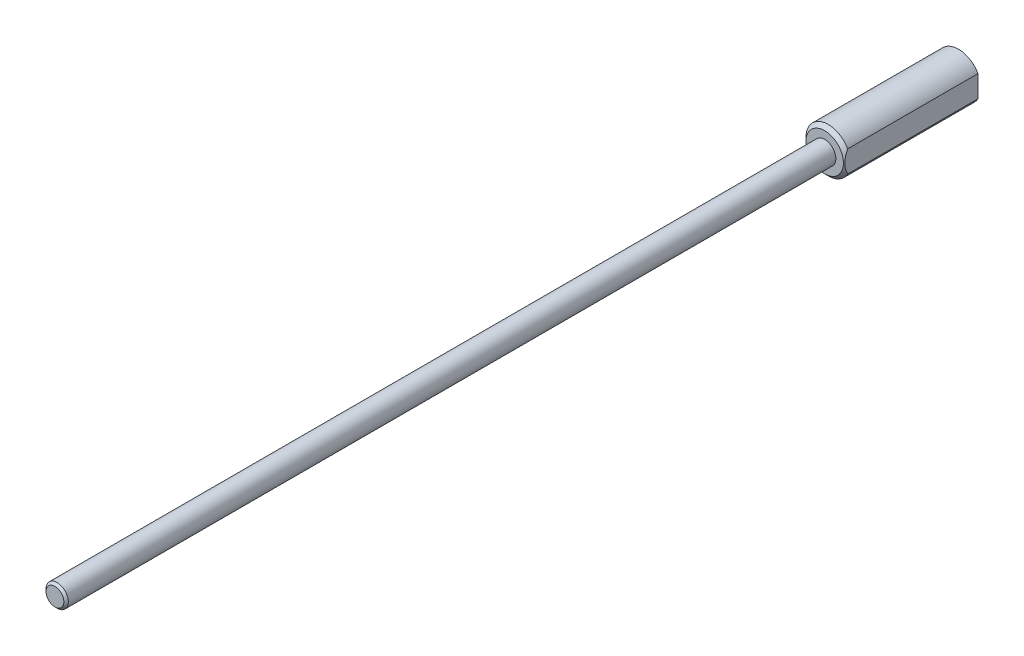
ISO-10303-21;
HEADER;
FILE_DESCRIPTION(('STEP AP214'),'2;1');
FILE_NAME('part.step','',(''),(''),'','','');
FILE_SCHEMA(('AUTOMOTIVE_DESIGN { 1 0 10303 214 1 1 1 1 }'));
ENDSEC;
DATA;
#1=APPLICATION_CONTEXT('core data for automotive mechanical design processes');
#2=APPLICATION_PROTOCOL_DEFINITION('international standard','automotive_design',2000,#1);
#3=PRODUCT_CONTEXT('',#1,'mechanical');
#4=PRODUCT('Part','Part','',(#3));
#5=PRODUCT_RELATED_PRODUCT_CATEGORY('part','',(#4));
#6=PRODUCT_DEFINITION_FORMATION('','',#4);
#7=PRODUCT_DEFINITION_CONTEXT('part definition',#1,'design');
#8=PRODUCT_DEFINITION('design','',#6,#7);
#9=PRODUCT_DEFINITION_SHAPE('','',#8);
#10=(LENGTH_UNIT() NAMED_UNIT(*) SI_UNIT(.MILLI.,.METRE.));
#11=(NAMED_UNIT(*) PLANE_ANGLE_UNIT() SI_UNIT($,.RADIAN.));
#12=(NAMED_UNIT(*) SI_UNIT($,.STERADIAN.) SOLID_ANGLE_UNIT());
#13=UNCERTAINTY_MEASURE_WITH_UNIT(LENGTH_MEASURE(1.E-05),#10,'distance_accuracy_value','');
#14=(GEOMETRIC_REPRESENTATION_CONTEXT(3) GLOBAL_UNCERTAINTY_ASSIGNED_CONTEXT((#13)) GLOBAL_UNIT_ASSIGNED_CONTEXT((#10,
#11,#12)) REPRESENTATION_CONTEXT('',''));
#15=CARTESIAN_POINT('',(0.,0.,0.));
#16=DIRECTION('',(0.,0.,1.));
#17=DIRECTION('',(1.,0.,0.));
#18=AXIS2_PLACEMENT_3D('',#15,#16,#17);
#19=CARTESIAN_POINT('',(0.,0.,257.175));
#20=DIRECTION('',(0.,0.,-1.));
#21=DIRECTION('',(-1.,0.,0.));
#22=AXIS2_PLACEMENT_3D('',#19,#20,#21);
#23=CYLINDRICAL_SURFACE('',#22,3.175);
#24=CARTESIAN_POINT('',(0.,0.,256.54));
#25=DIRECTION('',(0.,0.,1.));
#26=DIRECTION('',(1.,0.,0.));
#27=AXIS2_PLACEMENT_3D('',#24,#25,#26);
#28=CIRCLE('',#27,3.175);
#29=CARTESIAN_POINT('',(3.175,0.,256.54));
#30=VERTEX_POINT('',#29);
#31=EDGE_CURVE('E11',#30,#30,#28,.F.);
#32=ORIENTED_EDGE('',*,*,#31,.T.);
#33=EDGE_LOOP('',(#32));
#34=FACE_BOUND('',#33,.T.);
#35=CARTESIAN_POINT('',(0.,0.,19.05));
#36=DIRECTION('',(0.,0.,1.));
#37=DIRECTION('',(1.,0.,0.));
#38=AXIS2_PLACEMENT_3D('',#35,#36,#37);
#39=CIRCLE('',#38,3.175);
#40=CARTESIAN_POINT('',(3.175,0.,19.05));
#41=VERTEX_POINT('',#40);
#42=EDGE_CURVE('E54',#41,#41,#39,.T.);
#43=ORIENTED_EDGE('',*,*,#42,.T.);
#44=EDGE_LOOP('',(#43));
#45=FACE_BOUND('',#44,.T.);
#46=ADVANCED_FACE('F43',(#34,#45),#23,.T.);
#47=CARTESIAN_POINT('',(0.,0.,257.175));
#48=DIRECTION('',(0.,0.,1.));
#49=DIRECTION('',(1.,0.,0.));
#50=AXIS2_PLACEMENT_3D('',#47,#48,#49);
#51=PLANE('',#50);
#52=CARTESIAN_POINT('',(0.,0.,257.175));
#53=DIRECTION('',(0.,0.,1.));
#54=DIRECTION('',(1.,0.,0.));
#55=AXIS2_PLACEMENT_3D('',#52,#53,#54);
#56=CIRCLE('',#55,2.54000000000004);
#57=CARTESIAN_POINT('',(2.54000000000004,0.,257.175));
#58=VERTEX_POINT('',#57);
#59=EDGE_CURVE('E50',#58,#58,#56,.T.);
#60=ORIENTED_EDGE('',*,*,#59,.T.);
#61=EDGE_LOOP('',(#60));
#62=FACE_BOUND('',#61,.T.);
#63=ADVANCED_FACE('F64',(#62),#51,.T.);
#64=CARTESIAN_POINT('',(0.,0.,19.05));
#65=DIRECTION('',(0.,0.,1.));
#66=DIRECTION('',(1.,0.,0.));
#67=AXIS2_PLACEMENT_3D('',#64,#65,#66);
#68=PLANE('',#67);
#69=ORIENTED_EDGE('',*,*,#42,.F.);
#70=EDGE_LOOP('',(#69));
#71=FACE_BOUND('',#70,.T.);
#72=ADVANCED_FACE('F62',(#71),#68,.F.);
#73=CARTESIAN_POINT('',(0.,0.,257.175));
#74=DIRECTION('',(0.,0.,-1.));
#75=DIRECTION('',(-1.,0.,0.));
#76=AXIS2_PLACEMENT_3D('',#73,#74,#75);
#77=CONICAL_SURFACE('',#76,2.54000000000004,0.785398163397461);
#78=ORIENTED_EDGE('',*,*,#31,.F.);
#79=EDGE_LOOP('',(#78));
#80=FACE_BOUND('',#79,.T.);
#81=ORIENTED_EDGE('',*,*,#59,.F.);
#82=EDGE_LOOP('',(#81));
#83=FACE_BOUND('',#82,.T.);
#84=ADVANCED_FACE('F45',(#80,#83),#77,.T.);
#85=CLOSED_SHELL('',(#46,#63,#72,#84));
#86=MANIFOLD_SOLID_BREP('B2',#85);
#87=CARTESIAN_POINT('',(0.,0.,0.));
#88=DIRECTION('',(0.,0.,1.));
#89=DIRECTION('',(1.,0.,0.));
#90=AXIS2_PLACEMENT_3D('',#87,#88,#89);
#91=PLANE('',#90);
#92=CARTESIAN_POINT('',(0.,0.,0.));
#93=DIRECTION('',(0.,0.,1.));
#94=DIRECTION('',(1.,0.,0.));
#95=AXIS2_PLACEMENT_3D('',#92,#93,#94);
#96=CIRCLE('',#95,3.175);
#97=CARTESIAN_POINT('',(-3.175,0.,0.));
#98=VERTEX_POINT('',#97);
#99=EDGE_CURVE('E132',#98,#98,#96,.T.);
#100=ORIENTED_EDGE('',*,*,#99,.T.);
#101=EDGE_LOOP('',(#100));
#102=FACE_BOUND('',#101,.T.);
#103=DIRECTION('',(0.,1.,0.));
#104=VECTOR('',#103,1.);
#105=CARTESIAN_POINT('',(5.5372,0.,0.));
#106=LINE('',#105,#104);
#107=CARTESIAN_POINT('',(5.5372,-3.10836229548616,0.));
#108=VERTEX_POINT('',#107);
#109=CARTESIAN_POINT('',(5.5372,3.10836229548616,0.));
#110=VERTEX_POINT('',#109);
#111=EDGE_CURVE('E127',#108,#110,#106,.T.);
#112=ORIENTED_EDGE('',*,*,#111,.F.);
#113=CARTESIAN_POINT('',(0.,0.,0.));
#114=DIRECTION('',(0.,0.,1.));
#115=DIRECTION('',(1.,0.,0.));
#116=AXIS2_PLACEMENT_3D('',#113,#114,#115);
#117=CIRCLE('',#116,6.35);
#118=EDGE_CURVE('E137',#110,#108,#117,.T.);
#119=ORIENTED_EDGE('',*,*,#118,.F.);
#120=EDGE_LOOP('',(#112,#119));
#121=FACE_BOUND('',#120,.T.);
#122=ADVANCED_FACE('F98',(#102,#121),#91,.F.);
#123=CARTESIAN_POINT('',(0.,0.,38.1));
#124=DIRECTION('',(0.,0.,-1.));
#125=DIRECTION('',(-1.,0.,0.));
#126=AXIS2_PLACEMENT_3D('',#123,#124,#125);
#127=CYLINDRICAL_SURFACE('',#126,6.35);
#128=DIRECTION('',(0.,0.,-1.));
#129=VECTOR('',#128,1.);
#130=CARTESIAN_POINT('',(5.5372,-3.10836229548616,100.276418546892));
#131=LINE('',#130,#129);
#132=CARTESIAN_POINT('',(5.5372,-3.10836229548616,37.084));
#133=VERTEX_POINT('',#132);
#134=EDGE_CURVE('E122',#133,#108,#131,.T.);
#135=ORIENTED_EDGE('',*,*,#134,.F.);
#136=CARTESIAN_POINT('',(0.,0.,37.084));
#137=DIRECTION('',(0.,0.,1.));
#138=DIRECTION('',(1.,0.,0.));
#139=AXIS2_PLACEMENT_3D('',#136,#137,#138);
#140=CIRCLE('',#139,6.35);
#141=CARTESIAN_POINT('',(5.5372,3.10836229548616,37.084));
#142=VERTEX_POINT('',#141);
#143=EDGE_CURVE('E111',#133,#142,#140,.F.);
#144=ORIENTED_EDGE('',*,*,#143,.T.);
#145=DIRECTION('',(0.,0.,-1.));
#146=VECTOR('',#145,1.);
#147=CARTESIAN_POINT('',(5.5372,3.10836229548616,100.276418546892));
#148=LINE('',#147,#146);
#149=EDGE_CURVE('E118',#142,#110,#148,.T.);
#150=ORIENTED_EDGE('',*,*,#149,.T.);
#151=ORIENTED_EDGE('',*,*,#118,.T.);
#152=EDGE_LOOP('',(#135,#144,#150,#151));
#153=FACE_BOUND('',#152,.T.);
#154=ADVANCED_FACE('F136',(#153),#127,.T.);
#155=CARTESIAN_POINT('',(0.,0.,38.1));
#156=DIRECTION('',(0.,0.,-1.));
#157=DIRECTION('',(-1.,0.,0.));
#158=AXIS2_PLACEMENT_3D('',#155,#156,#157);
#159=CONICAL_SURFACE('',#158,5.33400000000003,0.785398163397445);
#160=CARTESIAN_POINT('',(0.,0.,38.1));
#161=DIRECTION('',(0.,0.,1.));
#162=DIRECTION('',(1.,0.,0.));
#163=AXIS2_PLACEMENT_3D('',#160,#161,#162);
#164=CIRCLE('',#163,5.33400000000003);
#165=CARTESIAN_POINT('',(5.33400000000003,0.,38.1));
#166=VERTEX_POINT('',#165);
#167=EDGE_CURVE('E140',#166,#166,#164,.T.);
#168=ORIENTED_EDGE('',*,*,#167,.F.);
#169=EDGE_LOOP('',(#168));
#170=FACE_BOUND('',#169,.T.);
#171=ORIENTED_EDGE('',*,*,#143,.F.);
#172=CARTESIAN_POINT('',(5.5372,-6.4420345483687,34.9392726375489));
#173=CARTESIAN_POINT('',(5.5372,-6.28547249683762,35.057975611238));
#174=CARTESIAN_POINT('',(5.5372,-6.12804129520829,35.1755507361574));
#175=CARTESIAN_POINT('',(5.5372,-5.81109490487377,35.4079379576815));
#176=CARTESIAN_POINT('',(5.5372,-5.65157920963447,35.5227493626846));
#177=CARTESIAN_POINT('',(5.5372,-5.32895115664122,35.7499185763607));
#178=CARTESIAN_POINT('',(5.5372,-5.16582051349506,35.8622505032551));
#179=CARTESIAN_POINT('',(5.5372,-4.83680191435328,36.0827876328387));
#180=CARTESIAN_POINT('',(5.5372,-4.67091415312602,36.1909931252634));
#181=CARTESIAN_POINT('',(5.5372,-4.32613098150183,36.4085417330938));
#182=CARTESIAN_POINT('',(5.5372,-4.14704261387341,36.517580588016));
#183=CARTESIAN_POINT('',(5.5372,-3.78467875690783,36.728578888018));
#184=CARTESIAN_POINT('',(5.5372,-3.60140260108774,36.8305371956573));
#185=CARTESIAN_POINT('',(5.5372,-3.23066500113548,37.0251808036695));
#186=CARTESIAN_POINT('',(5.5372,-3.04321798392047,37.11789336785));
#187=CARTESIAN_POINT('',(5.5372,-2.66316842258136,37.2919694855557));
#188=CARTESIAN_POINT('',(5.5372,-2.47056828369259,37.3733382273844));
#189=CARTESIAN_POINT('',(5.5372,-2.09644461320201,37.5155255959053));
#190=CARTESIAN_POINT('',(5.5372,-1.91536542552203,37.5775013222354));
#191=CARTESIAN_POINT('',(5.5372,-1.54878961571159,37.6869343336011));
#192=CARTESIAN_POINT('',(5.5372,-1.36329269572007,37.7343906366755));
#193=CARTESIAN_POINT('',(5.5372,-0.992106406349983,37.81149702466));
#194=CARTESIAN_POINT('',(5.5372,-0.806482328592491,37.8414562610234));
#195=CARTESIAN_POINT('',(5.5372,-0.433176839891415,37.8829765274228));
#196=CARTESIAN_POINT('',(5.5372,-0.245495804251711,37.894540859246));
#197=CARTESIAN_POINT('',(5.5372,0.122963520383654,37.8983835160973));
#198=CARTESIAN_POINT('',(5.5372,0.303734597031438,37.8913742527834));
#199=CARTESIAN_POINT('',(5.5372,0.66376038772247,37.8600443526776));
#200=CARTESIAN_POINT('',(5.5372,0.843014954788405,37.8357220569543));
#201=CARTESIAN_POINT('',(5.5372,1.20174221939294,37.7706902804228));
#202=CARTESIAN_POINT('',(5.5372,1.38116310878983,37.7296996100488));
#203=CARTESIAN_POINT('',(5.5372,1.73608700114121,37.6335368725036));
#204=CARTESIAN_POINT('',(5.5372,1.91159030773,37.5783659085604));
#205=CARTESIAN_POINT('',(5.5372,2.273084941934,37.4509834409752));
#206=CARTESIAN_POINT('',(5.5372,2.45870291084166,37.3777233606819));
#207=CARTESIAN_POINT('',(5.5372,2.82512967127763,37.2199375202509));
#208=CARTESIAN_POINT('',(5.5372,3.0059361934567,37.1354065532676));
#209=CARTESIAN_POINT('',(5.5372,3.36361614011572,36.9570882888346));
#210=CARTESIAN_POINT('',(5.5372,3.54047502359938,36.8632720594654));
#211=CARTESIAN_POINT('',(5.5372,3.89012727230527,36.6684546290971));
#212=CARTESIAN_POINT('',(5.5372,4.062921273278,36.5674545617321));
#213=CARTESIAN_POINT('',(5.5372,4.39648932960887,36.3648388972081));
#214=CARTESIAN_POINT('',(5.5372,4.557434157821,36.2635029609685));
#215=CARTESIAN_POINT('',(5.5372,4.87656016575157,36.0565561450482));
#216=CARTESIAN_POINT('',(5.5372,5.03474113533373,35.950944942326));
#217=CARTESIAN_POINT('',(5.5372,5.34742105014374,35.7370805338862));
#218=CARTESIAN_POINT('',(5.5372,5.50193944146,35.6288556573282));
#219=CARTESIAN_POINT('',(5.5372,5.80886239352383,35.4095336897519));
#220=CARTESIAN_POINT('',(5.5372,5.96126752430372,35.2984373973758));
#221=CARTESIAN_POINT('',(5.5372,6.11278732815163,35.1861667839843));
#222=B_SPLINE_CURVE_WITH_KNOTS('',3,(#172,#173,#174,#175,#176,#177,#178,#179,#180,#181,#182,
#183,#184,#185,#186,#187,#188,#189,#190,#191,#192,#193,#194,#195,#196,#197,#198,#199,#200,#201,
#202,#203,#204,#205,#206,#207,#208,#209,#210,#211,#212,#213,#214,#215,#216,#217,#218,#219,#220,
#221),.UNSPECIFIED.,.F.,.F.,(4,2,2,2,2,2,2,2,2,2,2,2,2,2,2,2,2,2,2,2,2,2,2,2,4),(0.,
0.58943376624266,1.17901353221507,1.77315843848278,2.36726155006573,2.99614573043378,
3.6251307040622,4.25220239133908,4.87898632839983,5.45265835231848,6.02636916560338,
6.58960997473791,7.1527496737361,7.69460501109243,8.23651227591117,8.78796789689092,
9.33938062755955,9.93757293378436,10.5360425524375,11.136439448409,11.7367418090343,
12.3072322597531,12.8777658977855,13.4436782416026,14.0094348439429),.UNSPECIFIED.);
#223=EDGE_CURVE('E41',#133,#142,#222,.T.);
#224=ORIENTED_EDGE('',*,*,#223,.T.);
#225=EDGE_LOOP('',(#171,#224));
#226=FACE_BOUND('',#225,.T.);
#227=ADVANCED_FACE('F100',(#170,#226),#159,.T.);
#228=CARTESIAN_POINT('',(0.,0.,38.1));
#229=DIRECTION('',(0.,0.,1.));
#230=DIRECTION('',(1.,0.,0.));
#231=AXIS2_PLACEMENT_3D('',#228,#229,#230);
#232=PLANE('',#231);
#233=ORIENTED_EDGE('',*,*,#167,.T.);
#234=EDGE_LOOP('',(#233));
#235=FACE_BOUND('',#234,.T.);
#236=CARTESIAN_POINT('',(0.,0.,38.1));
#237=DIRECTION('',(0.,0.,1.));
#238=DIRECTION('',(1.,0.,0.));
#239=AXIS2_PLACEMENT_3D('',#236,#237,#238);
#240=CIRCLE('',#239,3.175);
#241=CARTESIAN_POINT('',(-3.175,0.,38.1));
#242=VERTEX_POINT('',#241);
#243=EDGE_CURVE('E141',#242,#242,#240,.T.);
#244=ORIENTED_EDGE('',*,*,#243,.F.);
#245=EDGE_LOOP('',(#244));
#246=FACE_BOUND('',#245,.T.);
#247=ADVANCED_FACE('F155',(#235,#246),#232,.T.);
#248=CARTESIAN_POINT('',(0.,0.,38.1));
#249=DIRECTION('',(0.,0.,-1.));
#250=DIRECTION('',(-1.,0.,0.));
#251=AXIS2_PLACEMENT_3D('',#248,#249,#250);
#252=CYLINDRICAL_SURFACE('',#251,3.175);
#253=CARTESIAN_POINT('',(-3.175,0.,38.1));
#254=CARTESIAN_POINT('',(-3.175,0.,37.703125));
#255=CARTESIAN_POINT('',(-3.175,0.,37.30625));
#256=CARTESIAN_POINT('',(-3.175,0.,36.5125));
#257=CARTESIAN_POINT('',(-3.175,0.,36.115625));
#258=CARTESIAN_POINT('',(-3.175,0.,35.321875));
#259=CARTESIAN_POINT('',(-3.175,0.,34.925));
#260=CARTESIAN_POINT('',(-3.175,0.,34.13125));
#261=CARTESIAN_POINT('',(-3.175,0.,33.734375));
#262=CARTESIAN_POINT('',(-3.175,0.,32.940625));
#263=CARTESIAN_POINT('',(-3.175,0.,32.54375));
#264=CARTESIAN_POINT('',(-3.175,0.,31.75));
#265=CARTESIAN_POINT('',(-3.175,0.,31.353125));
#266=CARTESIAN_POINT('',(-3.175,0.,30.559375));
#267=CARTESIAN_POINT('',(-3.175,0.,30.1625));
#268=CARTESIAN_POINT('',(-3.175,0.,29.36875));
#269=CARTESIAN_POINT('',(-3.175,0.,28.971875));
#270=CARTESIAN_POINT('',(-3.175,0.,28.178125));
#271=CARTESIAN_POINT('',(-3.175,0.,27.78125));
#272=CARTESIAN_POINT('',(-3.175,0.,26.9875));
#273=CARTESIAN_POINT('',(-3.175,0.,26.590625));
#274=CARTESIAN_POINT('',(-3.175,0.,25.796875));
#275=CARTESIAN_POINT('',(-3.175,0.,25.4));
#276=CARTESIAN_POINT('',(-3.175,0.,24.60625));
#277=CARTESIAN_POINT('',(-3.175,0.,24.209375));
#278=CARTESIAN_POINT('',(-3.175,0.,23.415625));
#279=CARTESIAN_POINT('',(-3.175,0.,23.01875));
#280=CARTESIAN_POINT('',(-3.175,0.,22.225));
#281=CARTESIAN_POINT('',(-3.175,0.,21.828125));
#282=CARTESIAN_POINT('',(-3.175,0.,21.034375));
#283=CARTESIAN_POINT('',(-3.175,0.,20.6375));
#284=CARTESIAN_POINT('',(-3.175,0.,19.84375));
#285=CARTESIAN_POINT('',(-3.175,0.,19.446875));
#286=CARTESIAN_POINT('',(-3.175,0.,18.653125));
#287=CARTESIAN_POINT('',(-3.175,0.,18.25625));
#288=CARTESIAN_POINT('',(-3.175,0.,17.4625));
#289=CARTESIAN_POINT('',(-3.175,0.,17.065625));
#290=CARTESIAN_POINT('',(-3.175,0.,16.271875));
#291=CARTESIAN_POINT('',(-3.175,0.,15.875));
#292=CARTESIAN_POINT('',(-3.175,0.,15.08125));
#293=CARTESIAN_POINT('',(-3.175,0.,14.684375));
#294=CARTESIAN_POINT('',(-3.175,0.,13.890625));
#295=CARTESIAN_POINT('',(-3.175,0.,13.49375));
#296=CARTESIAN_POINT('',(-3.175,0.,12.7));
#297=CARTESIAN_POINT('',(-3.175,0.,12.303125));
#298=CARTESIAN_POINT('',(-3.175,0.,11.509375));
#299=CARTESIAN_POINT('',(-3.175,0.,11.1125));
#300=CARTESIAN_POINT('',(-3.175,0.,10.31875));
#301=CARTESIAN_POINT('',(-3.175,0.,9.921875));
#302=CARTESIAN_POINT('',(-3.175,0.,9.128125));
#303=CARTESIAN_POINT('',(-3.175,0.,8.73125));
#304=CARTESIAN_POINT('',(-3.175,0.,7.9375));
#305=CARTESIAN_POINT('',(-3.175,0.,7.540625));
#306=CARTESIAN_POINT('',(-3.175,0.,6.746875));
#307=CARTESIAN_POINT('',(-3.175,0.,6.35));
#308=CARTESIAN_POINT('',(-3.175,0.,5.55625));
#309=CARTESIAN_POINT('',(-3.175,0.,5.159375));
#310=CARTESIAN_POINT('',(-3.175,0.,4.365625));
#311=CARTESIAN_POINT('',(-3.175,0.,3.96875));
#312=CARTESIAN_POINT('',(-3.175,0.,3.175));
#313=CARTESIAN_POINT('',(-3.175,0.,2.778125));
#314=CARTESIAN_POINT('',(-3.175,0.,1.984375));
#315=CARTESIAN_POINT('',(-3.175,0.,1.5875));
#316=CARTESIAN_POINT('',(-3.175,0.,0.79375));
#317=CARTESIAN_POINT('',(-3.175,0.,0.396875));
#318=CARTESIAN_POINT('',(-3.175,0.,0.));
#319=B_SPLINE_CURVE_WITH_KNOTS('',3,(#253,#254,#255,#256,#257,#258,#259,#260,#261,#262,#263,
#264,#265,#266,#267,#268,#269,#270,#271,#272,#273,#274,#275,#276,#277,#278,#279,#280,#281,#282,
#283,#284,#285,#286,#287,#288,#289,#290,#291,#292,#293,#294,#295,#296,#297,#298,#299,#300,#301,
#302,#303,#304,#305,#306,#307,#308,#309,#310,#311,#312,#313,#314,#315,#316,#317,#318),
.UNSPECIFIED.,.F.,.F.,(4,2,2,2,2,2,2,2,2,2,2,2,2,2,2,2,2,2,2,2,2,2,2,2,2,2,2,2,2,2,2,2,4),(0.,
1.19062499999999,2.38124999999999,3.571875,4.7625,5.953125,7.14375,8.33437499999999,9.525,
10.715625,11.90625,13.096875,14.2875,15.478125,16.66875,17.859375,19.05,20.240625,21.43125,
22.621875,23.8125,25.003125,26.19375,27.384375,28.575,29.765625,30.95625,32.146875,33.3375,
34.528125,35.71875,36.909375,38.1),.UNSPECIFIED.);
#320=EDGE_CURVE('BSEAM153',#242,#98,#319,.T.);
#321=ORIENTED_EDGE('',*,*,#243,.T.);
#322=ORIENTED_EDGE('',*,*,#99,.F.);
#323=ORIENTED_EDGE('',*,*,#320,.T.);
#324=ORIENTED_EDGE('',*,*,#320,.F.);
#325=EDGE_LOOP('',(#321,#323,#322,#324));
#326=FACE_BOUND('',#325,.T.);
#327=ADVANCED_FACE('F153',(#326),#252,.F.);
#328=CARTESIAN_POINT('',(5.5372,3.10836229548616,100.276418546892));
#329=DIRECTION('',(1.,0.,0.));
#330=DIRECTION('',(0.,0.,-1.));
#331=AXIS2_PLACEMENT_3D('',#328,#329,#330);
#332=PLANE('',#331);
#333=ORIENTED_EDGE('',*,*,#134,.T.);
#334=ORIENTED_EDGE('',*,*,#111,.T.);
#335=ORIENTED_EDGE('',*,*,#149,.F.);
#336=ORIENTED_EDGE('',*,*,#223,.F.);
#337=EDGE_LOOP('',(#333,#334,#335,#336));
#338=FACE_BOUND('',#337,.T.);
#339=ADVANCED_FACE('F128',(#338),#332,.T.);
#340=CLOSED_SHELL('',(#122,#154,#227,#247,#327,#339));
#341=MANIFOLD_SOLID_BREP('B6',#340);
#342=ADVANCED_BREP_SHAPE_REPRESENTATION('',(#18,#86,#341),#14);
#343=SHAPE_DEFINITION_REPRESENTATION(#9,#342);
ENDSEC;
END-ISO-10303-21;
